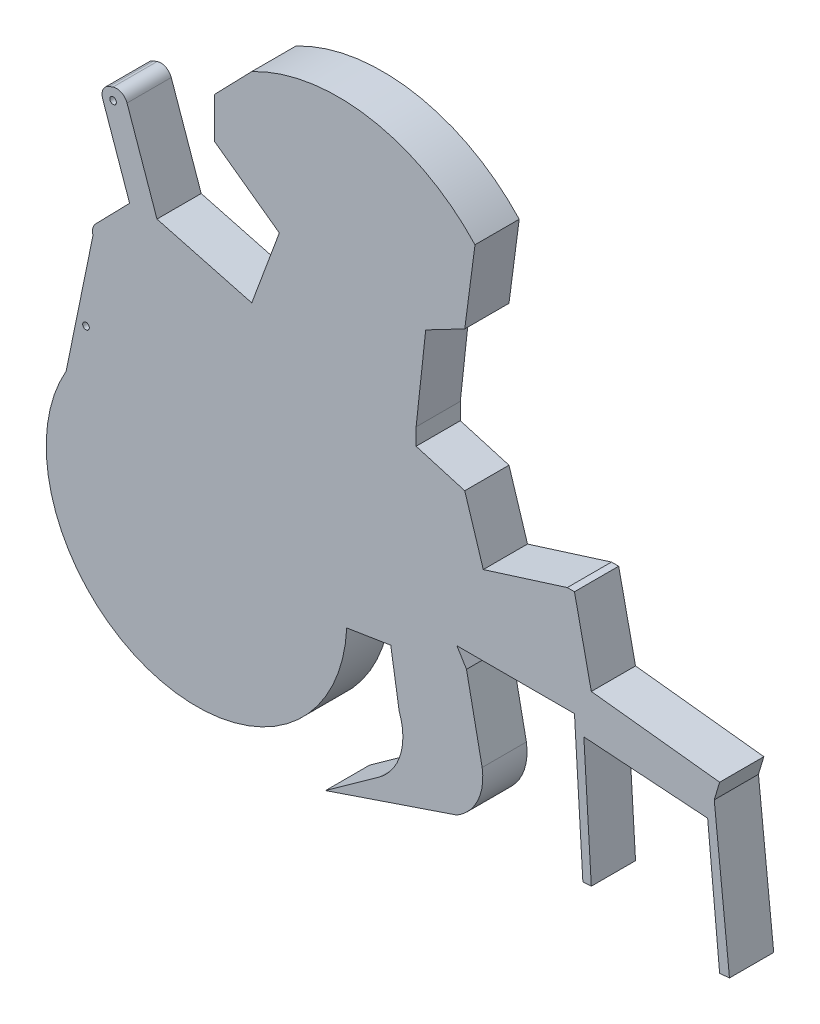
from build123d import *

# Parameters (mm, degrees)
EXTRUSION1_DEPTH        = 10
ESQUISSE2_R             = 0.75
ENL_V_MAT_EXTRU_1_DEPTH = 149.708734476
ECHELLE1_SCALE          = 10.83


with BuildPart() as part:
    # Esquisse1 → Extrusion1 (new body)
    with BuildSketch(Plane.XY):
        with BuildLine():
            Line((42.906732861, -38.256143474), (52.859280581, -36.669505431))
            Line((52.859280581, -36.669505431), (54.774641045, -48.684039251))
            ThreePointArc((54.774641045, -48.684039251), (55.068389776, -56.959350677), (50.32494295, -63.746601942))
            Line((50.32494295, -63.746601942), (38.105853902, -72.507489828))
            Line((38.105853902, -72.507489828), (67.815533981, -62.457383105))
            ThreePointArc((67.815533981, -62.457383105), (72.536829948, -57.242560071), (73.527298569, -50.278079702))
            Line((73.527298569, -50.278079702), (69.985631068, -32.822718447))
            Line((69.985631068, -32.822718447), (67.815533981, -29.29631068))
            Line((67.815533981, -29.29631068), (94.399223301, -29.29631068))
            Line((94.399223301, -29.29631068), (96.298058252, -61.305242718))
            Line((96.298058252, -61.305242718), (98.206269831, -61.192043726))
            Line((98.206269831, -61.192043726), (96.521124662, -32.785310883))
            Line((96.521124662, -32.785310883), (124.509320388, -34.721553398))
            Line((124.509320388, -34.721553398), (127.221941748, -63.746601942))
            Line((127.221941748, -63.746601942), (129.448644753, -63.538498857))
            Line((129.448644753, -63.538498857), (126.000060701, -30.377778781))
            Line((126.000060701, -30.377778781), (127.221941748, -26.312427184))
            Line((127.221941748, -26.312427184), (98.206269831, -23.057281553))
            Line((98.206269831, -23.057281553), (94.399223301, -5.425242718))
            Line((94.399223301, -5.425242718), (92.771650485, -5.425242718))
            Line((92.771650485, -5.425242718), (73.783300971, -11.393009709))
            Line((73.783300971, -11.393009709), (71.90771706, -5.425242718))
            Line((71.90771706, -5.425242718), (69.591232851, 1.945388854))
            Line((69.591232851, 1.945388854), (58.592621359, 5.153980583))
            Line((58.592621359, 5.153980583), (58.592621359, 8.951650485))
            Line((58.592621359, 8.951650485), (60.762718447, 29.025048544))
            Line((60.762718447, 29.025048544), (69.591232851, 33.636504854))
            Line((69.591232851, 33.636504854), (71.90771706, 51.268543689))
            ThreePointArc((71.90771706, 51.268543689), (48.141116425, 64.1710273), (21.429708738, 59.948932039))
            Line((21.429708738, 59.948932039), (13.020582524, 51.268543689))
            Line((13.020582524, 51.268543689), (13.020582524, 42.045631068))
            Line((13.020582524, 42.045631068), (27.668737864, 31.466407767))
            Line((27.668737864, 31.466407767), (21.429708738, 14.64815534))
            Line((21.429708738, 14.64815534), (0, 20.344660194))
            Line((0, 20.344660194), (-6.769463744, 39.685985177))
            ThreePointArc((-6.769463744, 39.685985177), (-8.044570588, 41.11261329), (-9.954985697, 41.219755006))
            Line((-9.954985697, 41.219755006), (-10.745517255, 40.943068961))
            ThreePointArc((-10.745517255, 40.943068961), (-12.172145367, 39.667962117), (-12.279287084, 37.757547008))
            Line((-12.279287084, 37.757547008), (-6.184776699, 20.344660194))
            Line((-6.184776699, 20.344660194), (-13.867942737, 12.470608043))
            ThreePointArc((-13.867942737, 12.470608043), (-14.512177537, 11.297199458), (-14.458691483, 9.959639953))
            Line((-14.458691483, 9.959639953), (-20.537830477, -19.709036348))
            ThreePointArc((-20.537830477, -19.709036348), (-0.586913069, -69.249196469), (42.906732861, -38.256143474))
        make_face()
    extrude(amount=-EXTRUSION1_DEPTH)

    # Esquisse2 → Enl_v. mat.-Extru.1 (cut, through all)
    with BuildSketch(Plane.XY):
        with Locations((-9.919641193, 38.58342307)):
            Circle(ESQUISSE2_R)
        with Locations((-16.048349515, -8.62038835)):
            Circle(ESQUISSE2_R)
    extrude(amount=-ENL_V_MAT_EXTRU_1_DEPTH, mode=Mode.SUBTRACT)


with BuildPart() as part_1:
    # Echelle1: scaled about (33.636803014, -10.137923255, -5)
    add(part.part.scale(ECHELLE1_SCALE).moved(Location((-330.649773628, 99.655785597, 49.15))))


solid = part_1.part
